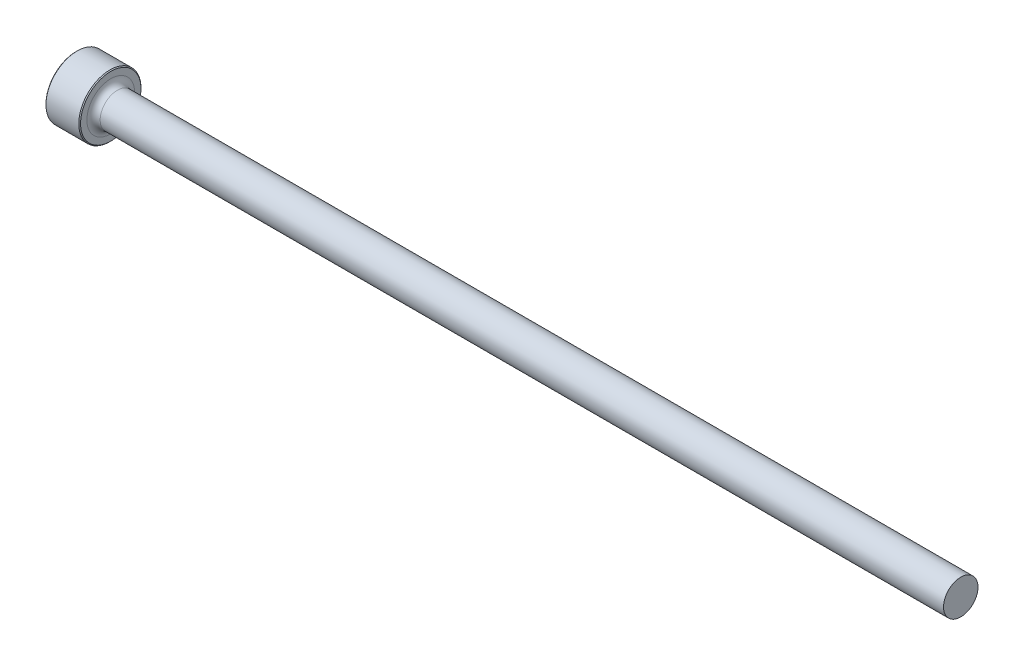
from build123d import *

# Parameters (mm, degrees)
CHAMFER1_SIZE = 0.1016


with BuildPart() as part:
    # Sketch1 → Revolve1 (revolve)
    with BuildSketch(Plane.XY):
        with BuildLine():
            Line((0, 0), (0, 3.571875))
            Line((0, 3.571875), (3.96875, 3.571875))
            Line((3.96875, 3.571875), (3.96875, 2.742565))
            ThreePointArc((3.96875, 2.742565), (4.191934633, 2.203749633), (4.73075, 1.980565))
            Line((4.73075, 1.980565), (101.6, 1.980565))
            Line((101.6, 1.980565), (101.6, 0))
            Line((101.6, 0), (0, 0))
        make_face()
    revolve(axis=Axis((101.6, 0, 0), (-1, 0, 0)))

    # Chamfer1
    chamfer1_edges = [part.edges().sort_by_distance(p)[0] for p in [
        (0, -3.571875, 0),
        (3.96875, -3.571875, 0),
    ]]
    chamfer(chamfer1_edges, length=CHAMFER1_SIZE)


solid = part.part
